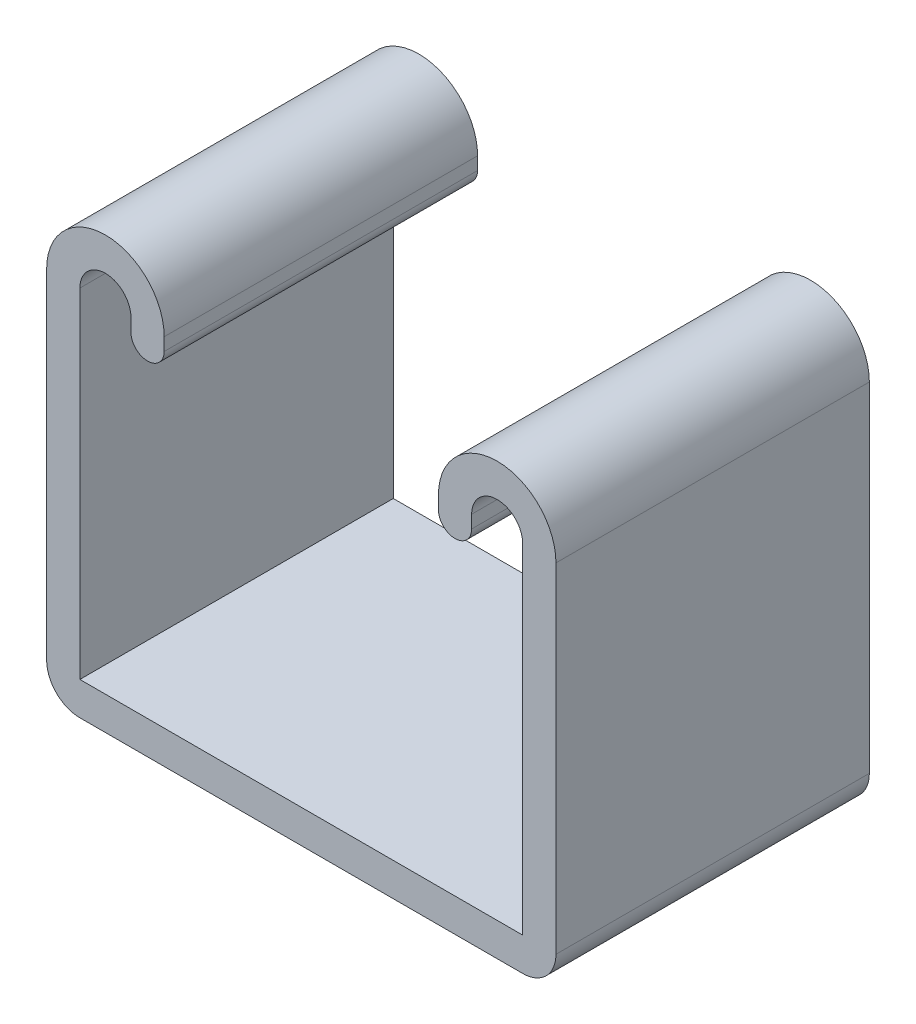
from build123d import *

# Parameters (mm, degrees)
BASE_EXTRUDE_DEPTH = 12.7


with BuildPart() as part:
    # Sketch1 → Base-Extrude (new, symmetric)
    with BuildSketch(Plane.XY):
        with BuildLine():
            Line((-20.6375, 15.1511), (-20.6375, -12.319))
            ThreePointArc((-20.6375, -12.319), (-19.848914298, -14.222814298), (-17.9451, -15.0114))
            Line((-17.9451, -15.0114), (17.9451, -15.0114))
            ThreePointArc((17.9451, -15.0114), (19.848914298, -14.222814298), (20.6375, -12.319))
            Line((20.6375, -12.319), (20.6375, 15.1511))
            ThreePointArc((20.6375, 15.1511), (15.875, 19.9136), (11.1125, 15.1511))
            Line((11.1125, 15.1511), (11.1125, 14.11605))
            ThreePointArc((11.1125, 14.11605), (12.4587, 12.76985), (13.8049, 14.11605))
            Line((13.8049, 14.11605), (13.8049, 15.1511))
            ThreePointArc((13.8049, 15.1511), (15.875, 17.2212), (17.9451, 15.1511))
            Line((17.9451, 15.1511), (17.9451, -12.319))
            Line((17.9451, -12.319), (-17.9451, -12.319))
            Line((-17.9451, -12.319), (-17.9451, 15.1511))
            ThreePointArc((-17.9451, 15.1511), (-15.875, 17.2212), (-13.8049, 15.1511))
            Line((-13.8049, 15.1511), (-13.8049, 14.11605))
            ThreePointArc((-13.8049, 14.11605), (-12.4587, 12.76985), (-11.1125, 14.11605))
            Line((-11.1125, 14.11605), (-11.1125, 15.1511))
            ThreePointArc((-11.1125, 15.1511), (-15.875, 19.9136), (-20.6375, 15.1511))
        make_face()
    extrude(amount=BASE_EXTRUDE_DEPTH, both=True)


solid = part.part
